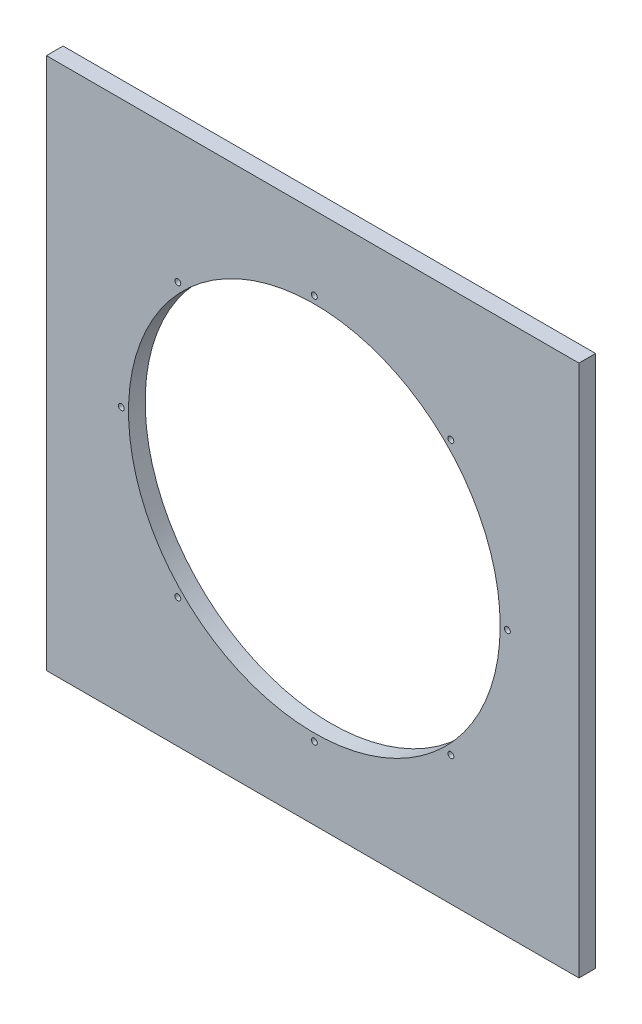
from build123d import *

# Parameters (mm, degrees)
SKETCH1_W           = 609.6
SKETCH1_H           = 609.6
BOSS_EXTRUDE1_DEPTH = 19.05
SKETCH2_R           = 3.3655
SKETCH2_R_2         = 212.725
CUT_EXTRUDE1_DEPTH  = 432.473037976


with BuildPart() as part:
    # Sketch1 → Boss-Extrude1 (new body)
    with BuildSketch(Plane.XY):
        Rectangle(SKETCH1_W, SKETCH1_H)
    extrude(amount=BOSS_EXTRUDE1_DEPTH)

    # Sketch2 → Cut-Extrude1 (cut, through all)
    with BuildSketch(Plane.XY.offset(19.05)):
        with Locations((1.909125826, 220.236669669)):
            Circle(SKETCH2_R)
        with Locations((158.179950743, 155.507174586)):
            Circle(SKETCH2_R)
        with Locations((222.909445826, -0.763650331)):
            Circle(SKETCH2_R)
        with Locations((158.179950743, -157.034475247)):
            Circle(SKETCH2_R)
        with Locations((1.909125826, -221.763970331)):
            Circle(SKETCH2_R)
        with Locations((-154.36169909, -157.034475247)):
            Circle(SKETCH2_R)
        with Locations((-219.091194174, -0.763650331)):
            Circle(SKETCH2_R)
        with Locations((-154.36169909, 155.507174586)):
            Circle(SKETCH2_R)
        with Locations((1.909125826, -0.763650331)):
            Circle(SKETCH2_R_2)
    extrude(amount=-CUT_EXTRUDE1_DEPTH, mode=Mode.SUBTRACT)


solid = part.part
